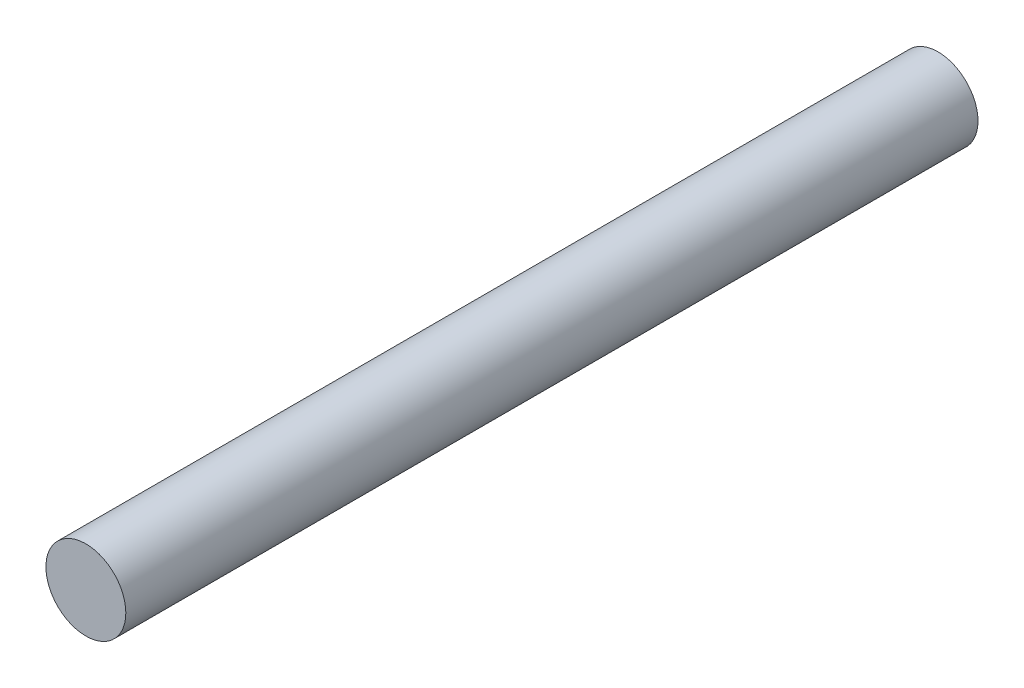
ISO-10303-21;
HEADER;
FILE_DESCRIPTION(('STEP AP214'),'2;1');
FILE_NAME('part.step','',(''),(''),'','','');
FILE_SCHEMA(('AUTOMOTIVE_DESIGN { 1 0 10303 214 1 1 1 1 }'));
ENDSEC;
DATA;
#1=APPLICATION_CONTEXT('core data for automotive mechanical design processes');
#2=APPLICATION_PROTOCOL_DEFINITION('international standard','automotive_design',2000,#1);
#3=PRODUCT_CONTEXT('',#1,'mechanical');
#4=PRODUCT('Part','Part','',(#3));
#5=PRODUCT_RELATED_PRODUCT_CATEGORY('part','',(#4));
#6=PRODUCT_DEFINITION_FORMATION('','',#4);
#7=PRODUCT_DEFINITION_CONTEXT('part definition',#1,'design');
#8=PRODUCT_DEFINITION('design','',#6,#7);
#9=PRODUCT_DEFINITION_SHAPE('','',#8);
#10=(LENGTH_UNIT() NAMED_UNIT(*) SI_UNIT(.MILLI.,.METRE.));
#11=(NAMED_UNIT(*) PLANE_ANGLE_UNIT() SI_UNIT($,.RADIAN.));
#12=(NAMED_UNIT(*) SI_UNIT($,.STERADIAN.) SOLID_ANGLE_UNIT());
#13=UNCERTAINTY_MEASURE_WITH_UNIT(LENGTH_MEASURE(1.E-05),#10,'distance_accuracy_value','');
#14=(GEOMETRIC_REPRESENTATION_CONTEXT(3) GLOBAL_UNCERTAINTY_ASSIGNED_CONTEXT((#13)) GLOBAL_UNIT_ASSIGNED_CONTEXT((#10,
#11,#12)) REPRESENTATION_CONTEXT('',''));
#15=CARTESIAN_POINT('',(0.,0.,0.));
#16=DIRECTION('',(0.,0.,1.));
#17=DIRECTION('',(1.,0.,0.));
#18=AXIS2_PLACEMENT_3D('',#15,#16,#17);
#19=CARTESIAN_POINT('',(0.,0.,0.));
#20=DIRECTION('',(0.,0.,1.));
#21=DIRECTION('',(1.,0.,0.));
#22=AXIS2_PLACEMENT_3D('',#19,#20,#21);
#23=CYLINDRICAL_SURFACE('',#22,3.);
#24=CARTESIAN_POINT('',(0.,0.,0.));
#25=DIRECTION('',(0.,0.,1.));
#26=DIRECTION('',(1.,0.,0.));
#27=AXIS2_PLACEMENT_3D('',#24,#25,#26);
#28=CIRCLE('',#27,3.);
#29=CARTESIAN_POINT('',(3.,0.,0.));
#30=VERTEX_POINT('',#29);
#31=EDGE_CURVE('E8',#30,#30,#28,.T.);
#32=ORIENTED_EDGE('',*,*,#31,.T.);
#33=EDGE_LOOP('',(#32));
#34=FACE_BOUND('',#33,.T.);
#35=CARTESIAN_POINT('',(0.,0.,64.));
#36=DIRECTION('',(0.,0.,1.));
#37=DIRECTION('',(1.,0.,0.));
#38=AXIS2_PLACEMENT_3D('',#35,#36,#37);
#39=CIRCLE('',#38,3.);
#40=CARTESIAN_POINT('',(3.,0.,64.));
#41=VERTEX_POINT('',#40);
#42=EDGE_CURVE('E18',#41,#41,#39,.T.);
#43=ORIENTED_EDGE('',*,*,#42,.F.);
#44=EDGE_LOOP('',(#43));
#45=FACE_BOUND('',#44,.T.);
#46=ADVANCED_FACE('F12',(#34,#45),#23,.T.);
#47=CARTESIAN_POINT('',(0.,0.,0.));
#48=DIRECTION('',(0.,0.,1.));
#49=DIRECTION('',(1.,0.,0.));
#50=AXIS2_PLACEMENT_3D('',#47,#48,#49);
#51=PLANE('',#50);
#52=ORIENTED_EDGE('',*,*,#31,.F.);
#53=EDGE_LOOP('',(#52));
#54=FACE_BOUND('',#53,.T.);
#55=ADVANCED_FACE('F27',(#54),#51,.F.);
#56=CARTESIAN_POINT('',(0.,0.,64.));
#57=DIRECTION('',(0.,0.,1.));
#58=DIRECTION('',(1.,0.,0.));
#59=AXIS2_PLACEMENT_3D('',#56,#57,#58);
#60=PLANE('',#59);
#61=ORIENTED_EDGE('',*,*,#42,.T.);
#62=EDGE_LOOP('',(#61));
#63=FACE_BOUND('',#62,.T.);
#64=ADVANCED_FACE('F24',(#63),#60,.T.);
#65=CLOSED_SHELL('',(#46,#55,#64));
#66=MANIFOLD_SOLID_BREP('B1',#65);
#67=ADVANCED_BREP_SHAPE_REPRESENTATION('',(#18,#66),#14);
#68=SHAPE_DEFINITION_REPRESENTATION(#9,#67);
ENDSEC;
END-ISO-10303-21;
